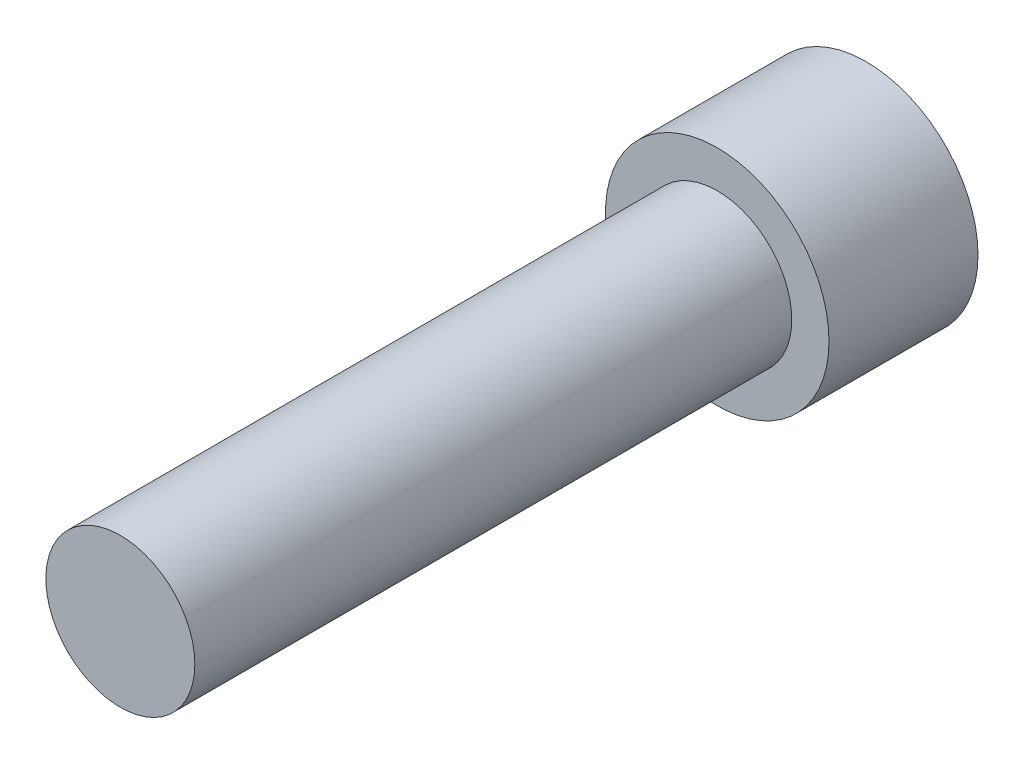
ISO-10303-21;
HEADER;
FILE_DESCRIPTION(('STEP AP214'),'2;1');
FILE_NAME('part.step','',(''),(''),'','','');
FILE_SCHEMA(('AUTOMOTIVE_DESIGN { 1 0 10303 214 1 1 1 1 }'));
ENDSEC;
DATA;
#1=APPLICATION_CONTEXT('core data for automotive mechanical design processes');
#2=APPLICATION_PROTOCOL_DEFINITION('international standard','automotive_design',2000,#1);
#3=PRODUCT_CONTEXT('',#1,'mechanical');
#4=PRODUCT('Part','Part','',(#3));
#5=PRODUCT_RELATED_PRODUCT_CATEGORY('part','',(#4));
#6=PRODUCT_DEFINITION_FORMATION('','',#4);
#7=PRODUCT_DEFINITION_CONTEXT('part definition',#1,'design');
#8=PRODUCT_DEFINITION('design','',#6,#7);
#9=PRODUCT_DEFINITION_SHAPE('','',#8);
#10=(LENGTH_UNIT() NAMED_UNIT(*) SI_UNIT(.MILLI.,.METRE.));
#11=(NAMED_UNIT(*) PLANE_ANGLE_UNIT() SI_UNIT($,.RADIAN.));
#12=(NAMED_UNIT(*) SI_UNIT($,.STERADIAN.) SOLID_ANGLE_UNIT());
#13=UNCERTAINTY_MEASURE_WITH_UNIT(LENGTH_MEASURE(1.E-05),#10,'distance_accuracy_value','');
#14=(GEOMETRIC_REPRESENTATION_CONTEXT(3) GLOBAL_UNCERTAINTY_ASSIGNED_CONTEXT((#13)) GLOBAL_UNIT_ASSIGNED_CONTEXT((#10,
#11,#12)) REPRESENTATION_CONTEXT('',''));
#15=CARTESIAN_POINT('',(0.,0.,0.));
#16=DIRECTION('',(0.,0.,1.));
#17=DIRECTION('',(1.,0.,0.));
#18=AXIS2_PLACEMENT_3D('',#15,#16,#17);
#19=CARTESIAN_POINT('',(0.,0.,31.75));
#20=DIRECTION('',(0.,0.,1.));
#21=DIRECTION('',(1.,0.,0.));
#22=AXIS2_PLACEMENT_3D('',#19,#20,#21);
#23=PLANE('',#22);
#24=CARTESIAN_POINT('',(0.,0.,31.75));
#25=DIRECTION('',(0.,0.,1.));
#26=DIRECTION('',(1.,0.,0.));
#27=AXIS2_PLACEMENT_3D('',#24,#25,#26);
#28=CIRCLE('',#27,3.9624);
#29=CARTESIAN_POINT('',(3.9624,0.,31.75));
#30=VERTEX_POINT('',#29);
#31=EDGE_CURVE('E11',#30,#30,#28,.T.);
#32=ORIENTED_EDGE('',*,*,#31,.T.);
#33=EDGE_LOOP('',(#32));
#34=FACE_BOUND('',#33,.T.);
#35=ADVANCED_FACE('F32',(#34),#23,.T.);
#36=CARTESIAN_POINT('',(0.,0.,31.75));
#37=DIRECTION('',(0.,0.,1.));
#38=DIRECTION('',(1.,0.,0.));
#39=AXIS2_PLACEMENT_3D('',#36,#37,#38);
#40=CYLINDRICAL_SURFACE('',#39,3.9624);
#41=CARTESIAN_POINT('',(0.,0.,0.));
#42=DIRECTION('',(0.,0.,1.));
#43=DIRECTION('',(1.,0.,0.));
#44=AXIS2_PLACEMENT_3D('',#41,#42,#43);
#45=CIRCLE('',#44,3.9624);
#46=CARTESIAN_POINT('',(3.9624,0.,0.));
#47=VERTEX_POINT('',#46);
#48=EDGE_CURVE('E39',#47,#47,#45,.T.);
#49=ORIENTED_EDGE('',*,*,#48,.T.);
#50=EDGE_LOOP('',(#49));
#51=FACE_BOUND('',#50,.T.);
#52=ORIENTED_EDGE('',*,*,#31,.F.);
#53=EDGE_LOOP('',(#52));
#54=FACE_BOUND('',#53,.T.);
#55=ADVANCED_FACE('F146',(#51,#54),#40,.T.);
#56=CARTESIAN_POINT('',(0.,-3.9624,0.));
#57=DIRECTION('',(0.,0.,1.));
#58=DIRECTION('',(1.,0.,0.));
#59=AXIS2_PLACEMENT_3D('',#56,#57,#58);
#60=PLANE('',#59);
#61=CARTESIAN_POINT('',(0.,0.,0.));
#62=DIRECTION('',(0.,0.,1.));
#63=DIRECTION('',(1.,0.,0.));
#64=AXIS2_PLACEMENT_3D('',#61,#62,#63);
#65=CIRCLE('',#64,5.9436);
#66=CARTESIAN_POINT('',(5.9436,0.,0.));
#67=VERTEX_POINT('',#66);
#68=EDGE_CURVE('E141',#67,#67,#65,.T.);
#69=ORIENTED_EDGE('',*,*,#68,.T.);
#70=EDGE_LOOP('',(#69));
#71=FACE_BOUND('',#70,.T.);
#72=ORIENTED_EDGE('',*,*,#48,.F.);
#73=EDGE_LOOP('',(#72));
#74=FACE_BOUND('',#73,.T.);
#75=ADVANCED_FACE('F149',(#71,#74),#60,.T.);
#76=CARTESIAN_POINT('',(0.,0.,31.75));
#77=DIRECTION('',(0.,0.,1.));
#78=DIRECTION('',(1.,0.,0.));
#79=AXIS2_PLACEMENT_3D('',#76,#77,#78);
#80=CYLINDRICAL_SURFACE('',#79,5.9436);
#81=CARTESIAN_POINT('',(0.,0.,-7.9248));
#82=DIRECTION('',(0.,0.,1.));
#83=DIRECTION('',(1.,0.,0.));
#84=AXIS2_PLACEMENT_3D('',#81,#82,#83);
#85=CIRCLE('',#84,5.9436);
#86=CARTESIAN_POINT('',(5.9436,0.,-7.9248));
#87=VERTEX_POINT('',#86);
#88=EDGE_CURVE('E133',#87,#87,#85,.T.);
#89=ORIENTED_EDGE('',*,*,#88,.T.);
#90=EDGE_LOOP('',(#89));
#91=FACE_BOUND('',#90,.T.);
#92=ORIENTED_EDGE('',*,*,#68,.F.);
#93=EDGE_LOOP('',(#92));
#94=FACE_BOUND('',#93,.T.);
#95=ADVANCED_FACE('F151',(#91,#94),#80,.T.);
#96=CARTESIAN_POINT('',(0.,-5.9436,-7.9248));
#97=DIRECTION('',(0.,0.,-1.));
#98=DIRECTION('',(-1.,0.,0.));
#99=AXIS2_PLACEMENT_3D('',#96,#97,#98);
#100=PLANE('',#99);
#101=DIRECTION('',(0.866025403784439,-0.5,0.));
#102=VECTOR('',#101,1.);
#103=CARTESIAN_POINT('',(0.,3.66617420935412,-7.9248));
#104=LINE('',#103,#102);
#105=CARTESIAN_POINT('',(0.,3.66617420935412,-7.9248));
#106=VERTEX_POINT('',#105);
#107=CARTESIAN_POINT('',(3.175,1.83308710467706,-7.9248));
#108=VERTEX_POINT('',#107);
#109=EDGE_CURVE('E46',#106,#108,#104,.T.);
#110=ORIENTED_EDGE('',*,*,#109,.F.);
#111=DIRECTION('',(0.866025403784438,0.5,0.));
#112=VECTOR('',#111,1.);
#113=CARTESIAN_POINT('',(-3.175,1.83308710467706,-7.9248));
#114=LINE('',#113,#112);
#115=CARTESIAN_POINT('',(-3.175,1.83308710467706,-7.9248));
#116=VERTEX_POINT('',#115);
#117=EDGE_CURVE('E129',#116,#106,#114,.T.);
#118=ORIENTED_EDGE('',*,*,#117,.F.);
#119=DIRECTION('',(0.,1.,0.));
#120=VECTOR('',#119,1.);
#121=CARTESIAN_POINT('',(-3.175,-1.83308710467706,-7.9248));
#122=LINE('',#121,#120);
#123=CARTESIAN_POINT('',(-3.175,-1.83308710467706,-7.9248));
#124=VERTEX_POINT('',#123);
#125=EDGE_CURVE('E127',#124,#116,#122,.T.);
#126=ORIENTED_EDGE('',*,*,#125,.F.);
#127=DIRECTION('',(-0.866025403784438,0.5,0.));
#128=VECTOR('',#127,1.);
#129=CARTESIAN_POINT('',(0.,-3.66617420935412,-7.9248));
#130=LINE('',#129,#128);
#131=CARTESIAN_POINT('',(0.,-3.66617420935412,-7.9248));
#132=VERTEX_POINT('',#131);
#133=EDGE_CURVE('E94',#132,#124,#130,.T.);
#134=ORIENTED_EDGE('',*,*,#133,.F.);
#135=DIRECTION('',(-0.866025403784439,-0.5,0.));
#136=VECTOR('',#135,1.);
#137=CARTESIAN_POINT('',(3.175,-1.83308710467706,-7.9248));
#138=LINE('',#137,#136);
#139=CARTESIAN_POINT('',(3.175,-1.83308710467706,-7.9248));
#140=VERTEX_POINT('',#139);
#141=EDGE_CURVE('E123',#140,#132,#138,.T.);
#142=ORIENTED_EDGE('',*,*,#141,.F.);
#143=DIRECTION('',(0.,-1.,0.));
#144=VECTOR('',#143,1.);
#145=CARTESIAN_POINT('',(3.175,1.83308710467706,-7.9248));
#146=LINE('',#145,#144);
#147=EDGE_CURVE('E120',#108,#140,#146,.T.);
#148=ORIENTED_EDGE('',*,*,#147,.F.);
#149=EDGE_LOOP('',(#110,#118,#126,#134,#142,#148));
#150=FACE_BOUND('',#149,.T.);
#151=ORIENTED_EDGE('',*,*,#88,.F.);
#152=EDGE_LOOP('',(#151));
#153=FACE_BOUND('',#152,.T.);
#154=ADVANCED_FACE('F158',(#150,#153),#100,.T.);
#155=CARTESIAN_POINT('',(0.,3.66617420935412,-3.0988));
#156=DIRECTION('',(0.5,0.866025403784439,0.));
#157=DIRECTION('',(-0.866025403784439,0.5,0.));
#158=AXIS2_PLACEMENT_3D('',#155,#156,#157);
#159=PLANE('',#158);
#160=ORIENTED_EDGE('',*,*,#109,.T.);
#161=DIRECTION('',(0.,0.,-1.));
#162=VECTOR('',#161,1.);
#163=CARTESIAN_POINT('',(3.175,1.83308710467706,-3.0988));
#164=LINE('',#163,#162);
#165=CARTESIAN_POINT('',(3.175,1.83308710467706,-3.0988));
#166=VERTEX_POINT('',#165);
#167=EDGE_CURVE('E76',#166,#108,#164,.T.);
#168=ORIENTED_EDGE('',*,*,#167,.F.);
#169=DIRECTION('',(0.866025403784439,-0.5,0.));
#170=VECTOR('',#169,1.);
#171=CARTESIAN_POINT('',(0.,3.66617420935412,-3.0988));
#172=LINE('',#171,#170);
#173=CARTESIAN_POINT('',(0.,3.66617420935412,-3.0988));
#174=VERTEX_POINT('',#173);
#175=EDGE_CURVE('E131',#174,#166,#172,.T.);
#176=ORIENTED_EDGE('',*,*,#175,.F.);
#177=DIRECTION('',(0.,0.,-1.));
#178=VECTOR('',#177,1.);
#179=CARTESIAN_POINT('',(0.,3.66617420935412,-3.0988));
#180=LINE('',#179,#178);
#181=EDGE_CURVE('E54',#174,#106,#180,.T.);
#182=ORIENTED_EDGE('',*,*,#181,.T.);
#183=EDGE_LOOP('',(#160,#168,#176,#182));
#184=FACE_BOUND('',#183,.T.);
#185=ADVANCED_FACE('F189',(#184),#159,.F.);
#186=CARTESIAN_POINT('',(-3.175,1.83308710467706,-3.0988));
#187=DIRECTION('',(-0.5,0.866025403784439,0.));
#188=DIRECTION('',(-0.866025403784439,-0.5,0.));
#189=AXIS2_PLACEMENT_3D('',#186,#187,#188);
#190=PLANE('',#189);
#191=ORIENTED_EDGE('',*,*,#117,.T.);
#192=ORIENTED_EDGE('',*,*,#181,.F.);
#193=DIRECTION('',(0.866025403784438,0.5,0.));
#194=VECTOR('',#193,1.);
#195=CARTESIAN_POINT('',(-3.175,1.83308710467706,-3.0988));
#196=LINE('',#195,#194);
#197=CARTESIAN_POINT('',(-3.175,1.83308710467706,-3.0988));
#198=VERTEX_POINT('',#197);
#199=EDGE_CURVE('E106',#198,#174,#196,.T.);
#200=ORIENTED_EDGE('',*,*,#199,.F.);
#201=DIRECTION('',(0.,0.,-1.));
#202=VECTOR('',#201,1.);
#203=CARTESIAN_POINT('',(-3.175,1.83308710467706,-3.0988));
#204=LINE('',#203,#202);
#205=EDGE_CURVE('E98',#198,#116,#204,.T.);
#206=ORIENTED_EDGE('',*,*,#205,.T.);
#207=EDGE_LOOP('',(#191,#192,#200,#206));
#208=FACE_BOUND('',#207,.T.);
#209=ADVANCED_FACE('F199',(#208),#190,.F.);
#210=CARTESIAN_POINT('',(-3.175,-1.83308710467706,-3.0988));
#211=DIRECTION('',(-1.,0.,0.));
#212=DIRECTION('',(0.,-1.,0.));
#213=AXIS2_PLACEMENT_3D('',#210,#211,#212);
#214=PLANE('',#213);
#215=ORIENTED_EDGE('',*,*,#125,.T.);
#216=ORIENTED_EDGE('',*,*,#205,.F.);
#217=DIRECTION('',(0.,1.,0.));
#218=VECTOR('',#217,1.);
#219=CARTESIAN_POINT('',(-3.175,-1.83308710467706,-3.0988));
#220=LINE('',#219,#218);
#221=CARTESIAN_POINT('',(-3.175,-1.83308710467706,-3.0988));
#222=VERTEX_POINT('',#221);
#223=EDGE_CURVE('E102',#222,#198,#220,.T.);
#224=ORIENTED_EDGE('',*,*,#223,.F.);
#225=DIRECTION('',(0.,0.,-1.));
#226=VECTOR('',#225,1.);
#227=CARTESIAN_POINT('',(-3.175,-1.83308710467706,-3.0988));
#228=LINE('',#227,#226);
#229=EDGE_CURVE('E87',#222,#124,#228,.T.);
#230=ORIENTED_EDGE('',*,*,#229,.T.);
#231=EDGE_LOOP('',(#215,#216,#224,#230));
#232=FACE_BOUND('',#231,.T.);
#233=ADVANCED_FACE('F103',(#232),#214,.F.);
#234=CARTESIAN_POINT('',(0.,-3.66617420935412,-3.0988));
#235=DIRECTION('',(-0.5,-0.866025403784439,0.));
#236=DIRECTION('',(0.866025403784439,-0.5,0.));
#237=AXIS2_PLACEMENT_3D('',#234,#235,#236);
#238=PLANE('',#237);
#239=ORIENTED_EDGE('',*,*,#133,.T.);
#240=ORIENTED_EDGE('',*,*,#229,.F.);
#241=DIRECTION('',(-0.866025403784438,0.5,0.));
#242=VECTOR('',#241,1.);
#243=CARTESIAN_POINT('',(0.,-3.66617420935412,-3.0988));
#244=LINE('',#243,#242);
#245=CARTESIAN_POINT('',(0.,-3.66617420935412,-3.0988));
#246=VERTEX_POINT('',#245);
#247=EDGE_CURVE('E91',#246,#222,#244,.T.);
#248=ORIENTED_EDGE('',*,*,#247,.F.);
#249=DIRECTION('',(0.,0.,-1.));
#250=VECTOR('',#249,1.);
#251=CARTESIAN_POINT('',(0.,-3.66617420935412,-3.0988));
#252=LINE('',#251,#250);
#253=EDGE_CURVE('E99',#246,#132,#252,.T.);
#254=ORIENTED_EDGE('',*,*,#253,.T.);
#255=EDGE_LOOP('',(#239,#240,#248,#254));
#256=FACE_BOUND('',#255,.T.);
#257=ADVANCED_FACE('F89',(#256),#238,.F.);
#258=CARTESIAN_POINT('',(3.175,-1.83308710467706,-3.0988));
#259=DIRECTION('',(0.5,-0.866025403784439,0.));
#260=DIRECTION('',(0.866025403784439,0.5,0.));
#261=AXIS2_PLACEMENT_3D('',#258,#259,#260);
#262=PLANE('',#261);
#263=ORIENTED_EDGE('',*,*,#141,.T.);
#264=ORIENTED_EDGE('',*,*,#253,.F.);
#265=DIRECTION('',(-0.866025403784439,-0.5,0.));
#266=VECTOR('',#265,1.);
#267=CARTESIAN_POINT('',(3.175,-1.83308710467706,-3.0988));
#268=LINE('',#267,#266);
#269=CARTESIAN_POINT('',(3.175,-1.83308710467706,-3.0988));
#270=VERTEX_POINT('',#269);
#271=EDGE_CURVE('E112',#270,#246,#268,.T.);
#272=ORIENTED_EDGE('',*,*,#271,.F.);
#273=DIRECTION('',(0.,0.,-1.));
#274=VECTOR('',#273,1.);
#275=CARTESIAN_POINT('',(3.175,-1.83308710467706,-3.0988));
#276=LINE('',#275,#274);
#277=EDGE_CURVE('E136',#270,#140,#276,.T.);
#278=ORIENTED_EDGE('',*,*,#277,.T.);
#279=EDGE_LOOP('',(#263,#264,#272,#278));
#280=FACE_BOUND('',#279,.T.);
#281=ADVANCED_FACE('F224',(#280),#262,.F.);
#282=CARTESIAN_POINT('',(3.175,1.83308710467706,-3.0988));
#283=DIRECTION('',(1.,0.,0.));
#284=DIRECTION('',(0.,0.,-1.));
#285=AXIS2_PLACEMENT_3D('',#282,#283,#284);
#286=PLANE('',#285);
#287=ORIENTED_EDGE('',*,*,#147,.T.);
#288=ORIENTED_EDGE('',*,*,#277,.F.);
#289=DIRECTION('',(0.,-1.,0.));
#290=VECTOR('',#289,1.);
#291=CARTESIAN_POINT('',(3.175,1.83308710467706,-3.0988));
#292=LINE('',#291,#290);
#293=EDGE_CURVE('E114',#166,#270,#292,.T.);
#294=ORIENTED_EDGE('',*,*,#293,.F.);
#295=ORIENTED_EDGE('',*,*,#167,.T.);
#296=EDGE_LOOP('',(#287,#288,#294,#295));
#297=FACE_BOUND('',#296,.T.);
#298=ADVANCED_FACE('F233',(#297),#286,.F.);
#299=CARTESIAN_POINT('',(0.,3.66617420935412,-3.0988));
#300=DIRECTION('',(0.,0.,1.));
#301=DIRECTION('',(1.,0.,0.));
#302=AXIS2_PLACEMENT_3D('',#299,#300,#301);
#303=PLANE('',#302);
#304=ORIENTED_EDGE('',*,*,#175,.T.);
#305=ORIENTED_EDGE('',*,*,#293,.T.);
#306=ORIENTED_EDGE('',*,*,#271,.T.);
#307=ORIENTED_EDGE('',*,*,#247,.T.);
#308=ORIENTED_EDGE('',*,*,#223,.T.);
#309=ORIENTED_EDGE('',*,*,#199,.T.);
#310=EDGE_LOOP('',(#304,#305,#306,#307,#308,#309));
#311=FACE_BOUND('',#310,.T.);
#312=ADVANCED_FACE('F109',(#311),#303,.F.);
#313=CLOSED_SHELL('',(#35,#55,#75,#95,#154,#185,#209,#233,#257,#281,#298,#312));
#314=MANIFOLD_SOLID_BREP('B2',#313);
#315=ADVANCED_BREP_SHAPE_REPRESENTATION('',(#18,#314),#14);
#316=SHAPE_DEFINITION_REPRESENTATION(#9,#315);
ENDSEC;
END-ISO-10303-21;
